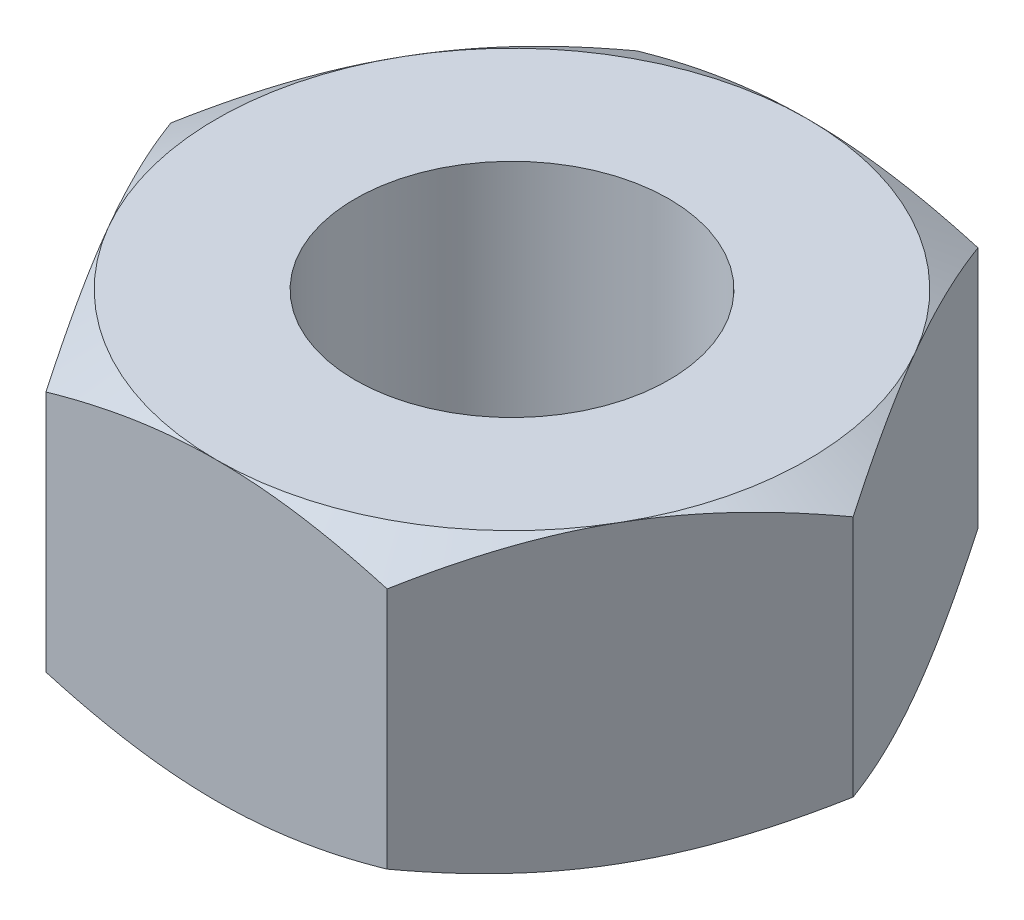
ISO-10303-21;
HEADER;
FILE_DESCRIPTION(('STEP AP214'),'2;1');
FILE_NAME('part.step','',(''),(''),'','','');
FILE_SCHEMA(('AUTOMOTIVE_DESIGN { 1 0 10303 214 1 1 1 1 }'));
ENDSEC;
DATA;
#1=APPLICATION_CONTEXT('core data for automotive mechanical design processes');
#2=APPLICATION_PROTOCOL_DEFINITION('international standard','automotive_design',2000,#1);
#3=PRODUCT_CONTEXT('',#1,'mechanical');
#4=PRODUCT('Part','Part','',(#3));
#5=PRODUCT_RELATED_PRODUCT_CATEGORY('part','',(#4));
#6=PRODUCT_DEFINITION_FORMATION('','',#4);
#7=PRODUCT_DEFINITION_CONTEXT('part definition',#1,'design');
#8=PRODUCT_DEFINITION('design','',#6,#7);
#9=PRODUCT_DEFINITION_SHAPE('','',#8);
#10=(LENGTH_UNIT() NAMED_UNIT(*) SI_UNIT(.MILLI.,.METRE.));
#11=(NAMED_UNIT(*) PLANE_ANGLE_UNIT() SI_UNIT($,.RADIAN.));
#12=(NAMED_UNIT(*) SI_UNIT($,.STERADIAN.) SOLID_ANGLE_UNIT());
#13=UNCERTAINTY_MEASURE_WITH_UNIT(LENGTH_MEASURE(1.E-05),#10,'distance_accuracy_value','');
#14=(GEOMETRIC_REPRESENTATION_CONTEXT(3) GLOBAL_UNCERTAINTY_ASSIGNED_CONTEXT((#13)) GLOBAL_UNIT_ASSIGNED_CONTEXT((#10,
#11,#12)) REPRESENTATION_CONTEXT('',''));
#15=CARTESIAN_POINT('',(0.,0.,0.));
#16=DIRECTION('',(0.,0.,1.));
#17=DIRECTION('',(1.,0.,0.));
#18=AXIS2_PLACEMENT_3D('',#15,#16,#17);
#19=CARTESIAN_POINT('',(4.61880215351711,8.,7.99999999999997));
#20=DIRECTION('',(-0.866025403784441,0.,-0.499999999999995));
#21=DIRECTION('',(-0.499999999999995,0.,0.866025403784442));
#22=AXIS2_PLACEMENT_3D('',#19,#20,#21);
#23=PLANE('',#22);
#24=CARTESIAN_POINT('',(9.23771977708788,0.71459784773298,-0.000200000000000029));
#25=CARTESIAN_POINT('',(9.13619343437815,0.655990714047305,0.175648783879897));
#26=CARTESIAN_POINT('',(9.0342885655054,0.600043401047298,0.352153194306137));
#27=CARTESIAN_POINT('',(8.82965122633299,0.494201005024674,0.706595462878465));
#28=CARTESIAN_POINT('',(8.72691841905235,0.444308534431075,0.884533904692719));
#29=CARTESIAN_POINT('',(8.41707512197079,0.304692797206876,1.42119823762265));
#30=CARTESIAN_POINT('',(8.20874154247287,0.225281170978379,1.78204258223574));
#31=CARTESIAN_POINT('',(7.89697436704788,0.132161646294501,2.32203917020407));
#32=CARTESIAN_POINT('',(7.79447216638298,0.105634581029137,2.4995781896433));
#33=CARTESIAN_POINT('',(7.58900421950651,0.0611531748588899,2.85545911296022));
#34=CARTESIAN_POINT('',(7.48603851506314,0.0431980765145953,3.03380094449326));
#35=CARTESIAN_POINT('',(7.2799298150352,0.0163156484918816,3.39079168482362));
#36=CARTESIAN_POINT('',(7.17678715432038,0.00737807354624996,3.56944001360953));
#37=CARTESIAN_POINT('',(6.97040655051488,-0.00127769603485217,3.92690170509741));
#38=CARTESIAN_POINT('',(6.86716861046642,-0.000996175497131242,4.10571506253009));
#39=CARTESIAN_POINT('',(6.67416139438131,0.00814502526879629,4.44001336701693));
#40=CARTESIAN_POINT('',(6.5843784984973,0.0158896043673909,4.5955219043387));
#41=CARTESIAN_POINT('',(6.40502298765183,0.0382011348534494,4.90617476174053));
#42=CARTESIAN_POINT('',(6.31545038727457,0.0527685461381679,5.06131905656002));
#43=CARTESIAN_POINT('',(6.0470793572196,0.106360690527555,5.52615131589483));
#44=CARTESIAN_POINT('',(5.86875596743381,0.155268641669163,5.83501648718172));
#45=CARTESIAN_POINT('',(5.51021755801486,0.27753940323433,6.45602322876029));
#46=CARTESIAN_POINT('',(5.33004829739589,0.351420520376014,6.76808554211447));
#47=CARTESIAN_POINT('',(4.97239658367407,0.519100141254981,7.38755648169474));
#48=CARTESIAN_POINT('',(4.79490955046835,0.612859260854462,7.69497304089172));
#49=CARTESIAN_POINT('',(4.61868668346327,0.71459784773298,8.00019999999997));
#50=B_SPLINE_CURVE_WITH_KNOTS('',3,(#24,#25,#26,#27,#28,#29,#30,#31,#32,#33,#34,#35,#36,#37,#38,
#39,#40,#41,#42,#43,#44,#45,#46,#47,#48,#49),.UNSPECIFIED.,.F.,.F.,(4,2,2,2,2,2,2,2,2,2,2,2,4),
(0.,0.633973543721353,1.26821965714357,2.53934712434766,3.1593434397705,3.77928496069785,
4.39852133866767,5.01773858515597,5.55680239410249,6.09590254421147,7.17487077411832,
8.27776850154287,9.37850115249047),.UNSPECIFIED.);
#51=CARTESIAN_POINT('',(9.23760430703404,0.714531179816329,0.));
#52=VERTEX_POINT('',#51);
#53=CARTESIAN_POINT('',(6.92820323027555,0.,3.99999999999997));
#54=VERTEX_POINT('',#53);
#55=EDGE_CURVE('E61',#52,#54,#50,.T.);
#56=ORIENTED_EDGE('',*,*,#55,.F.);
#57=DIRECTION('',(0.,-1.,0.));
#58=VECTOR('',#57,1.);
#59=CARTESIAN_POINT('',(9.23760430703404,8.,0.));
#60=LINE('',#59,#58);
#61=CARTESIAN_POINT('',(9.23760430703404,7.28546882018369,0.));
#62=VERTEX_POINT('',#61);
#63=EDGE_CURVE('E178',#62,#52,#60,.T.);
#64=ORIENTED_EDGE('',*,*,#63,.F.);
#65=CARTESIAN_POINT('',(4.61868668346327,7.28540215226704,8.00019999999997));
#66=CARTESIAN_POINT('',(4.720213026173,7.34400928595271,7.82435121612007));
#67=CARTESIAN_POINT('',(4.82211789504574,7.39995659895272,7.64784680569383));
#68=CARTESIAN_POINT('',(5.02675523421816,7.50579899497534,7.2934045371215));
#69=CARTESIAN_POINT('',(5.1294880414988,7.55569146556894,7.11546609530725));
#70=CARTESIAN_POINT('',(5.43933133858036,7.69530720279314,6.57880176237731));
#71=CARTESIAN_POINT('',(5.64766491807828,7.77471882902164,6.21795741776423));
#72=CARTESIAN_POINT('',(5.95943209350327,7.86783835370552,5.6779608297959));
#73=CARTESIAN_POINT('',(6.06193429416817,7.89436541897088,5.50042181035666));
#74=CARTESIAN_POINT('',(6.26740224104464,7.93884682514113,5.14454088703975));
#75=CARTESIAN_POINT('',(6.37036794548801,7.95680192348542,4.96619905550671));
#76=CARTESIAN_POINT('',(6.57647664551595,7.98368435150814,4.60920831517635));
#77=CARTESIAN_POINT('',(6.67961930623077,7.99262192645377,4.43055998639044));
#78=CARTESIAN_POINT('',(6.88599991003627,8.00127769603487,4.07309829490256));
#79=CARTESIAN_POINT('',(6.98923785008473,8.00099617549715,3.89428493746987));
#80=CARTESIAN_POINT('',(7.18224506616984,7.99185497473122,3.55998663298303));
#81=CARTESIAN_POINT('',(7.27202796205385,7.98411039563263,3.40447809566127));
#82=CARTESIAN_POINT('',(7.45138347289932,7.96179886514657,3.09382523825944));
#83=CARTESIAN_POINT('',(7.54095607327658,7.94723145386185,2.93868094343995));
#84=CARTESIAN_POINT('',(7.80932710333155,7.89363930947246,2.47384868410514));
#85=CARTESIAN_POINT('',(7.98765049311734,7.84473135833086,2.16498351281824));
#86=CARTESIAN_POINT('',(8.34618890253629,7.72246059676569,1.54397677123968));
#87=CARTESIAN_POINT('',(8.52635816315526,7.64857947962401,1.2319144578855));
#88=CARTESIAN_POINT('',(8.88400987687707,7.48089985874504,0.612443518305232));
#89=CARTESIAN_POINT('',(9.0614969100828,7.38714073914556,0.305026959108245));
#90=CARTESIAN_POINT('',(9.23771977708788,7.28540215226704,-0.000200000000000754));
#91=B_SPLINE_CURVE_WITH_KNOTS('',3,(#65,#66,#67,#68,#69,#70,#71,#72,#73,#74,#75,#76,#77,#78,#79,
#80,#81,#82,#83,#84,#85,#86,#87,#88,#89,#90),.UNSPECIFIED.,.F.,.F.,(4,2,2,2,2,2,2,2,2,2,2,2,4),
(0.,0.633973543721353,1.26821965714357,2.53934712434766,3.1593434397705,3.77928496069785,
4.39852133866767,5.01773858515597,5.55680239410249,6.09590254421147,7.17487077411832,
8.27776850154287,9.37850115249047),.UNSPECIFIED.);
#92=CARTESIAN_POINT('',(6.92820323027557,8.,3.99999999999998));
#93=VERTEX_POINT('',#92);
#94=EDGE_CURVE('E252',#93,#62,#91,.T.);
#95=ORIENTED_EDGE('',*,*,#94,.F.);
#96=CARTESIAN_POINT('',(4.61880215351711,7.28546882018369,7.99999999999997));
#97=VERTEX_POINT('',#96);
#98=EDGE_CURVE('E338',#97,#93,#91,.T.);
#99=ORIENTED_EDGE('',*,*,#98,.F.);
#100=DIRECTION('',(0.,-1.,0.));
#101=VECTOR('',#100,1.);
#102=CARTESIAN_POINT('',(4.61880215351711,8.,7.99999999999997));
#103=LINE('',#102,#101);
#104=CARTESIAN_POINT('',(4.61880215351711,0.714531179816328,7.99999999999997));
#105=VERTEX_POINT('',#104);
#106=EDGE_CURVE('E164',#97,#105,#103,.T.);
#107=ORIENTED_EDGE('',*,*,#106,.T.);
#108=EDGE_CURVE('E156',#54,#105,#50,.T.);
#109=ORIENTED_EDGE('',*,*,#108,.F.);
#110=EDGE_LOOP('',(#56,#64,#95,#99,#107,#109));
#111=FACE_BOUND('',#110,.T.);
#112=ADVANCED_FACE('F45',(#111),#23,.F.);
#113=CARTESIAN_POINT('',(9.23760430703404,8.,0.));
#114=DIRECTION('',(-0.866025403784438,0.,0.500000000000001));
#115=DIRECTION('',(0.500000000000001,0.,0.866025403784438));
#116=AXIS2_PLACEMENT_3D('',#113,#114,#115);
#117=PLANE('',#116);
#118=CARTESIAN_POINT('',(4.61868668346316,0.714597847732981,-8.00020000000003));
#119=CARTESIAN_POINT('',(4.72021302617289,0.655990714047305,-7.82435121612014));
#120=CARTESIAN_POINT('',(4.82211789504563,0.600043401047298,-7.6478468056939));
#121=CARTESIAN_POINT('',(5.02675523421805,0.494201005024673,-7.29340453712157));
#122=CARTESIAN_POINT('',(5.12948804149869,0.444308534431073,-7.11546609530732));
#123=CARTESIAN_POINT('',(5.43933133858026,0.30469279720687,-6.57880176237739));
#124=CARTESIAN_POINT('',(5.64766491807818,0.225281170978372,-6.21795741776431));
#125=CARTESIAN_POINT('',(5.95943209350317,0.132161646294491,-5.67796082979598));
#126=CARTESIAN_POINT('',(6.06193429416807,0.105634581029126,-5.50042181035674));
#127=CARTESIAN_POINT('',(6.26740224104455,0.0611531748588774,-5.14454088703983));
#128=CARTESIAN_POINT('',(6.37036794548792,0.0431980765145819,-4.96619905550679));
#129=CARTESIAN_POINT('',(6.57647664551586,0.0163156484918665,-4.60920831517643));
#130=CARTESIAN_POINT('',(6.67961930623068,0.00737807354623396,-4.43055998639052));
#131=CARTESIAN_POINT('',(6.88599991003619,-0.0012776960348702,-4.07309829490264));
#132=CARTESIAN_POINT('',(6.98923785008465,-0.000996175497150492,-3.89428493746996));
#133=CARTESIAN_POINT('',(7.18224506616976,0.00814502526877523,-3.55998663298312));
#134=CARTESIAN_POINT('',(7.27202796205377,0.0158896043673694,-3.40447809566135));
#135=CARTESIAN_POINT('',(7.45138347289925,0.0382011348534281,-3.09382523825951));
#136=CARTESIAN_POINT('',(7.54095607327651,0.0527685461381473,-2.93868094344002));
#137=CARTESIAN_POINT('',(7.8093271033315,0.106360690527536,-2.4738486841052));
#138=CARTESIAN_POINT('',(7.98765049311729,0.155268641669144,-2.16498351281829));
#139=CARTESIAN_POINT('',(8.34618890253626,0.277539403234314,-1.54397677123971));
#140=CARTESIAN_POINT('',(8.52635816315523,0.351420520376,-1.23191445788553));
#141=CARTESIAN_POINT('',(8.88400987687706,0.519100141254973,-0.612443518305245));
#142=CARTESIAN_POINT('',(9.06149691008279,0.612859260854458,-0.305026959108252));
#143=CARTESIAN_POINT('',(9.23771977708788,0.714597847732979,0.00019999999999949));
#144=B_SPLINE_CURVE_WITH_KNOTS('',3,(#118,#119,#120,#121,#122,#123,#124,#125,#126,#127,#128,
#129,#130,#131,#132,#133,#134,#135,#136,#137,#138,#139,#140,#141,#142,#143),.UNSPECIFIED.,.F.,
.F.,(4,2,2,2,2,2,2,2,2,2,2,2,4),(0.,0.633973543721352,1.26821965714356,2.53934712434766,
3.1593434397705,3.77928496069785,4.39852133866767,5.01773858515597,5.55680239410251,
6.0959025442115,7.17487077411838,8.27776850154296,9.37850115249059),.UNSPECIFIED.);
#145=CARTESIAN_POINT('',(4.618802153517,0.714531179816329,-8.00000000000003));
#146=VERTEX_POINT('',#145);
#147=CARTESIAN_POINT('',(6.92820323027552,0.,-4.00000000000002));
#148=VERTEX_POINT('',#147);
#149=EDGE_CURVE('E68',#146,#148,#144,.T.);
#150=ORIENTED_EDGE('',*,*,#149,.F.);
#151=DIRECTION('',(0.,-1.,0.));
#152=VECTOR('',#151,1.);
#153=CARTESIAN_POINT('',(4.618802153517,8.,-8.00000000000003));
#154=LINE('',#153,#152);
#155=CARTESIAN_POINT('',(4.618802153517,7.28546882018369,-8.00000000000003));
#156=VERTEX_POINT('',#155);
#157=EDGE_CURVE('E175',#156,#146,#154,.T.);
#158=ORIENTED_EDGE('',*,*,#157,.F.);
#159=CARTESIAN_POINT('',(9.23771977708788,7.28540215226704,0.000200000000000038));
#160=CARTESIAN_POINT('',(9.13619343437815,7.34400928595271,-0.175648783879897));
#161=CARTESIAN_POINT('',(9.0342885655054,7.39995659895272,-0.352153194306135));
#162=CARTESIAN_POINT('',(8.82965122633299,7.50579899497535,-0.70659546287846));
#163=CARTESIAN_POINT('',(8.72691841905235,7.55569146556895,-0.884533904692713));
#164=CARTESIAN_POINT('',(8.41707512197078,7.69530720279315,-1.42119823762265));
#165=CARTESIAN_POINT('',(8.20874154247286,7.77471882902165,-1.78204258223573));
#166=CARTESIAN_POINT('',(7.89697436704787,7.86783835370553,-2.32203917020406));
#167=CARTESIAN_POINT('',(7.79447216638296,7.89436541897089,-2.49957818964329));
#168=CARTESIAN_POINT('',(7.58900421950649,7.93884682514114,-2.85545911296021));
#169=CARTESIAN_POINT('',(7.48603851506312,7.95680192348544,-3.03380094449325));
#170=CARTESIAN_POINT('',(7.27992981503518,7.98368435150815,-3.3907916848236));
#171=CARTESIAN_POINT('',(7.17678715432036,7.99262192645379,-3.56944001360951));
#172=CARTESIAN_POINT('',(6.97040655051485,8.00127769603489,-3.92690170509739));
#173=CARTESIAN_POINT('',(6.86716861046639,8.00099617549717,-4.10571506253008));
#174=CARTESIAN_POINT('',(6.67416139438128,7.99185497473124,-4.44001336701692));
#175=CARTESIAN_POINT('',(6.58437849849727,7.98411039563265,-4.59552190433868));
#176=CARTESIAN_POINT('',(6.40502298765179,7.96179886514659,-4.90617476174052));
#177=CARTESIAN_POINT('',(6.31545038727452,7.94723145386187,-5.06131905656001));
#178=CARTESIAN_POINT('',(6.04707935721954,7.89363930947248,-5.52615131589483));
#179=CARTESIAN_POINT('',(5.86875596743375,7.84473135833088,-5.83501648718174));
#180=CARTESIAN_POINT('',(5.51021755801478,7.72246059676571,-6.45602322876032));
#181=CARTESIAN_POINT('',(5.33004829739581,7.64857947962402,-6.7680855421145));
#182=CARTESIAN_POINT('',(4.97239658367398,7.48089985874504,-7.38755648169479));
#183=CARTESIAN_POINT('',(4.79490955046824,7.38714073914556,-7.69497304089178));
#184=CARTESIAN_POINT('',(4.61868668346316,7.28540215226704,-8.00020000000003));
#185=B_SPLINE_CURVE_WITH_KNOTS('',3,(#159,#160,#161,#162,#163,#164,#165,#166,#167,#168,#169,
#170,#171,#172,#173,#174,#175,#176,#177,#178,#179,#180,#181,#182,#183,#184),.UNSPECIFIED.,.F.,
.F.,(4,2,2,2,2,2,2,2,2,2,2,2,4),(0.,0.633973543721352,1.26821965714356,2.53934712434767,
3.1593434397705,3.77928496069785,4.39852133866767,5.01773858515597,5.55680239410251,
6.0959025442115,7.17487077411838,8.27776850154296,9.37850115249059),.UNSPECIFIED.);
#186=CARTESIAN_POINT('',(6.92820323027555,8.,-4.00000000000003));
#187=VERTEX_POINT('',#186);
#188=EDGE_CURVE('E315',#187,#156,#185,.T.);
#189=ORIENTED_EDGE('',*,*,#188,.F.);
#190=EDGE_CURVE('E320',#62,#187,#185,.T.);
#191=ORIENTED_EDGE('',*,*,#190,.F.);
#192=ORIENTED_EDGE('',*,*,#63,.T.);
#193=EDGE_CURVE('E297',#148,#52,#144,.T.);
#194=ORIENTED_EDGE('',*,*,#193,.F.);
#195=EDGE_LOOP('',(#150,#158,#189,#191,#192,#194));
#196=FACE_BOUND('',#195,.T.);
#197=ADVANCED_FACE('F308',(#196),#117,.F.);
#198=CARTESIAN_POINT('',(4.618802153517,8.,-8.00000000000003));
#199=DIRECTION('',(0.,0.,1.));
#200=DIRECTION('',(1.,0.,0.));
#201=AXIS2_PLACEMENT_3D('',#198,#199,#200);
#202=PLANE('',#201);
#203=CARTESIAN_POINT('',(-12.6403241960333,4.01789852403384,-7.99999999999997));
#204=CARTESIAN_POINT('',(-12.2888430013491,3.84647215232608,-7.99999999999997));
#205=CARTESIAN_POINT('',(-11.9365795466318,3.67662339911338,-7.99999999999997));
#206=CARTESIAN_POINT('',(-11.2300728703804,3.34096412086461,-7.99999999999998));
#207=CARTESIAN_POINT('',(-10.8758293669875,3.17515418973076,-7.99999999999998));
#208=CARTESIAN_POINT('',(-10.1632322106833,2.84767085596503,-7.99999999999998));
#209=CARTESIAN_POINT('',(-9.80486680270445,2.68602294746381,-7.99999999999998));
#210=CARTESIAN_POINT('',(-9.08536584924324,2.36903857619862,-7.99999999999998));
#211=CARTESIAN_POINT('',(-8.72423042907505,2.21370182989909,-7.99999999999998));
#212=CARTESIAN_POINT('',(-7.98618087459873,1.90581143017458,-7.99999999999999));
#213=CARTESIAN_POINT('',(-7.60915019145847,1.75353567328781,-7.99999999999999));
#214=CARTESIAN_POINT('',(-6.85076602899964,1.45995337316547,-7.99999999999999));
#215=CARTESIAN_POINT('',(-6.46941208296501,1.31864802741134,-7.99999999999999));
#216=CARTESIAN_POINT('',(-5.70241102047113,1.05054563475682,-8.));
#217=CARTESIAN_POINT('',(-5.3167735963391,0.923721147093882,-8.));
#218=CARTESIAN_POINT('',(-4.53998544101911,0.688493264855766,-8.));
#219=CARTESIAN_POINT('',(-4.14883641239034,0.580084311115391,-8.));
#220=CARTESIAN_POINT('',(-3.36291309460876,0.387316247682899,-8.00000000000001));
#221=CARTESIAN_POINT('',(-2.96817310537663,0.30282097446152,-8.00000000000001));
#222=CARTESIAN_POINT('',(-2.37228929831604,0.197556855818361,-8.00000000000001));
#223=CARTESIAN_POINT('',(-2.17301971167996,0.16604730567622,-8.00000000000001));
#224=CARTESIAN_POINT('',(-1.77341268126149,0.110799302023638,-8.00000000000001));
#225=CARTESIAN_POINT('',(-1.57307534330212,0.0870600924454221,-8.00000000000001));
#226=CARTESIAN_POINT('',(-1.17432002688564,0.0481362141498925,-8.00000000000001));
#227=CARTESIAN_POINT('',(-0.975913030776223,0.0328395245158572,-8.00000000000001));
#228=CARTESIAN_POINT('',(-0.57862915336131,0.010658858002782,-8.00000000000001));
#229=CARTESIAN_POINT('',(-0.379752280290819,0.00377473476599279,-8.00000000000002));
#230=CARTESIAN_POINT('',(0.0181162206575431,-0.00141546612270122,-8.00000000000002));
#231=CARTESIAN_POINT('',(0.217107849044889,0.000278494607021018,-8.00000000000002));
#232=CARTESIAN_POINT('',(0.614837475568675,0.0122006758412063,-8.00000000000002));
#233=CARTESIAN_POINT('',(0.813575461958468,0.0224292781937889,-8.00000000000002));
#234=CARTESIAN_POINT('',(1.28422959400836,0.0565371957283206,-8.00000000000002));
#235=CARTESIAN_POINT('',(1.55588667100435,0.0840774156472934,-8.00000000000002));
#236=CARTESIAN_POINT('',(2.09732305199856,0.153653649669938,-8.00000000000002));
#237=CARTESIAN_POINT('',(2.36710212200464,0.195691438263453,-8.00000000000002));
#238=CARTESIAN_POINT('',(3.17322847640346,0.34133323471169,-8.00000000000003));
#239=CARTESIAN_POINT('',(3.70610589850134,0.464444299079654,-8.00000000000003));
#240=CARTESIAN_POINT('',(4.5033868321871,0.679733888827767,-8.00000000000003));
#241=CARTESIAN_POINT('',(4.77187301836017,0.757678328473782,-8.00000000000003));
#242=CARTESIAN_POINT('',(5.30624232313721,0.922110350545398,-8.00000000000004));
#243=CARTESIAN_POINT('',(5.57212542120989,1.00859800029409,-8.00000000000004));
#244=CARTESIAN_POINT('',(6.10136688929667,1.18869198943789,-8.00000000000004));
#245=CARTESIAN_POINT('',(6.36472592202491,1.28229639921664,-8.00000000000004));
#246=CARTESIAN_POINT('',(6.88922947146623,1.47547803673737,-8.00000000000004));
#247=CARTESIAN_POINT('',(7.15037404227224,1.57505511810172,-8.00000000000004));
#248=CARTESIAN_POINT('',(7.86355537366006,1.85485523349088,-8.00000000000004));
#249=CARTESIAN_POINT('',(8.31360309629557,2.04014375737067,-8.00000000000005));
#250=CARTESIAN_POINT('',(9.20895547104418,2.4218876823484,-8.00000000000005));
#251=CARTESIAN_POINT('',(9.65425955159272,2.61834441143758,-8.00000000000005));
#252=CARTESIAN_POINT('',(10.5412363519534,3.01973675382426,-8.00000000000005));
#253=CARTESIAN_POINT('',(10.9829075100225,3.2246758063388,-8.00000000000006));
#254=CARTESIAN_POINT('',(11.8631821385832,3.64096813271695,-8.00000000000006));
#255=CARTESIAN_POINT('',(12.3017857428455,3.8523211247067,-8.00000000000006));
#256=CARTESIAN_POINT('',(13.1772814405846,4.28038318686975,-8.00000000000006));
#257=CARTESIAN_POINT('',(13.6141694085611,4.49710067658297,-8.00000000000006));
#258=CARTESIAN_POINT('',(14.4859595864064,4.93449647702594,-8.00000000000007));
#259=CARTESIAN_POINT('',(14.9208617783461,5.15517482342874,-8.00000000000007));
#260=CARTESIAN_POINT('',(15.7889376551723,5.59965094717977,-8.00000000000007));
#261=CARTESIAN_POINT('',(16.2221117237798,5.82344797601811,-8.00000000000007));
#262=CARTESIAN_POINT('',(17.0871185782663,6.27362077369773,-8.00000000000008));
#263=CARTESIAN_POINT('',(17.5189513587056,6.49999655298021,-8.00000000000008));
#264=CARTESIAN_POINT('',(18.71912958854,7.13289882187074,-8.00000000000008));
#265=CARTESIAN_POINT('',(19.4862640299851,7.54172124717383,-8.00000000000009));
#266=CARTESIAN_POINT('',(21.0179839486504,8.36422301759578,-8.00000000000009));
#267=CARTESIAN_POINT('',(21.782569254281,8.77790268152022,-8.00000000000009));
#268=CARTESIAN_POINT('',(23.3071112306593,9.60742602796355,-8.0000000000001));
#269=CARTESIAN_POINT('',(24.0670747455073,10.0232571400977,-8.0000000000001));
#270=CARTESIAN_POINT('',(25.2058550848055,10.6490471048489,-8.00000000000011));
#271=CARTESIAN_POINT('',(25.5852388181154,10.8579756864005,-8.00000000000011));
#272=CARTESIAN_POINT('',(26.34366906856,11.2764429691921,-8.00000000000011));
#273=CARTESIAN_POINT('',(26.7227155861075,11.4859816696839,-8.00000000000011));
#274=CARTESIAN_POINT('',(27.1016142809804,11.6957873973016,-8.00000000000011));
#275=B_SPLINE_CURVE_WITH_KNOTS('',3,(#203,#204,#205,#206,#207,#208,#209,#210,#211,#212,#213,
#214,#215,#216,#217,#218,#219,#220,#221,#222,#223,#224,#225,#226,#227,#228,#229,#230,#231,#232,
#233,#234,#235,#236,#237,#238,#239,#240,#241,#242,#243,#244,#245,#246,#247,#248,#249,#250,#251,
#252,#253,#254,#255,#256,#257,#258,#259,#260,#261,#262,#263,#264,#265,#266,#267,#268,#269,#270,
#271,#272,#273,#274),.UNSPECIFIED.,.F.,.F.,(4,2,2,2,2,2,2,2,2,2,2,2,2,2,2,2,2,2,2,2,2,2,2,2,2,2,
2,2,2,2,2,2,2,2,2,4),(0.,1.17318598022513,2.3465434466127,3.52590216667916,4.70520784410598,
5.92493599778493,7.14479710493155,8.36230684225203,9.57944838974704,10.7895133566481,
11.3946221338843,11.9996720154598,12.5964878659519,13.1932933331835,13.7901014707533,
14.3869363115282,15.2056272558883,16.0244184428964,17.6627769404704,18.5014144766,
19.3400586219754,20.1784761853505,21.0168732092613,22.4767387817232,23.936778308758,
25.3974157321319,26.857989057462,28.321021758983,29.7840676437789,31.2467682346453,
32.7094747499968,35.3172586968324,37.9252147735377,40.5240797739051,41.8234055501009,
43.1227297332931),.UNSPECIFIED.);
#276=CARTESIAN_POINT('',(-4.61880215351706,0.714531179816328,-8.));
#277=VERTEX_POINT('',#276);
#278=CARTESIAN_POINT('',(0.,0.,-8.00000000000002));
#279=VERTEX_POINT('',#278);
#280=EDGE_CURVE('E329',#277,#279,#275,.T.);
#281=ORIENTED_EDGE('',*,*,#280,.F.);
#282=DIRECTION('',(0.,-1.,0.));
#283=VECTOR('',#282,1.);
#284=CARTESIAN_POINT('',(-4.61880215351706,8.,-8.));
#285=LINE('',#284,#283);
#286=CARTESIAN_POINT('',(-4.61880215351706,7.28546882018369,-8.));
#287=VERTEX_POINT('',#286);
#288=EDGE_CURVE('E166',#287,#277,#285,.T.);
#289=ORIENTED_EDGE('',*,*,#288,.F.);
#290=CARTESIAN_POINT('',(-12.6403241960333,3.98210147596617,-7.99999999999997));
#291=CARTESIAN_POINT('',(-12.2888430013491,4.15352784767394,-7.99999999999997));
#292=CARTESIAN_POINT('',(-11.9365795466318,4.32337660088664,-7.99999999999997));
#293=CARTESIAN_POINT('',(-11.2300728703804,4.6590358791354,-7.99999999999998));
#294=CARTESIAN_POINT('',(-10.8758293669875,4.82484581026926,-7.99999999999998));
#295=CARTESIAN_POINT('',(-10.1632322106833,5.15232914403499,-7.99999999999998));
#296=CARTESIAN_POINT('',(-9.80486680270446,5.3139770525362,-7.99999999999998));
#297=CARTESIAN_POINT('',(-9.08536584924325,5.6309614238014,-7.99999999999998));
#298=CARTESIAN_POINT('',(-8.72423042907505,5.78629817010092,-7.99999999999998));
#299=CARTESIAN_POINT('',(-7.98618087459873,6.09418856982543,-7.99999999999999));
#300=CARTESIAN_POINT('',(-7.60915019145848,6.24646432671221,-7.99999999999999));
#301=CARTESIAN_POINT('',(-6.85076602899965,6.54004662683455,-7.99999999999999));
#302=CARTESIAN_POINT('',(-6.46941208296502,6.68135197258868,-7.99999999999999));
#303=CARTESIAN_POINT('',(-5.70241102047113,6.9494543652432,-8.));
#304=CARTESIAN_POINT('',(-5.31677359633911,7.07627885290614,-8.));
#305=CARTESIAN_POINT('',(-4.53998544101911,7.31150673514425,-8.));
#306=CARTESIAN_POINT('',(-4.14883641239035,7.41991568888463,-8.));
#307=CARTESIAN_POINT('',(-3.36291309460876,7.61268375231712,-8.00000000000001));
#308=CARTESIAN_POINT('',(-2.96817310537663,7.6971790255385,-8.00000000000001));
#309=CARTESIAN_POINT('',(-2.37228929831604,7.80244314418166,-8.00000000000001));
#310=CARTESIAN_POINT('',(-2.17301971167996,7.8339526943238,-8.00000000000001));
#311=CARTESIAN_POINT('',(-1.77341268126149,7.88920069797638,-8.00000000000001));
#312=CARTESIAN_POINT('',(-1.57307534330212,7.9129399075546,-8.00000000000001));
#313=CARTESIAN_POINT('',(-1.17432002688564,7.95186378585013,-8.00000000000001));
#314=CARTESIAN_POINT('',(-0.975913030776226,7.96716047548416,-8.00000000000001));
#315=CARTESIAN_POINT('',(-0.578629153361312,7.98934114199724,-8.00000000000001));
#316=CARTESIAN_POINT('',(-0.379752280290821,7.99622526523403,-8.00000000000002));
#317=CARTESIAN_POINT('',(0.0181162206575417,8.00141546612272,-8.00000000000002));
#318=CARTESIAN_POINT('',(0.217107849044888,7.999721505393,-8.00000000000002));
#319=CARTESIAN_POINT('',(0.614837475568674,7.98779932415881,-8.00000000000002));
#320=CARTESIAN_POINT('',(0.813575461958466,7.97757072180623,-8.00000000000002));
#321=CARTESIAN_POINT('',(1.28422959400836,7.9434628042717,-8.00000000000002));
#322=CARTESIAN_POINT('',(1.55588667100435,7.91592258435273,-8.00000000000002));
#323=CARTESIAN_POINT('',(2.09732305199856,7.84634635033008,-8.00000000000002));
#324=CARTESIAN_POINT('',(2.36710212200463,7.80430856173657,-8.00000000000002));
#325=CARTESIAN_POINT('',(3.17322847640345,7.65866676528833,-8.00000000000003));
#326=CARTESIAN_POINT('',(3.70610589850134,7.53555570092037,-8.00000000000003));
#327=CARTESIAN_POINT('',(4.50338683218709,7.32026611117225,-8.00000000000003));
#328=CARTESIAN_POINT('',(4.77187301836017,7.24232167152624,-8.00000000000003));
#329=CARTESIAN_POINT('',(5.30624232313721,7.07788964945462,-8.00000000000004));
#330=CARTESIAN_POINT('',(5.57212542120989,6.99140199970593,-8.00000000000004));
#331=CARTESIAN_POINT('',(6.10136688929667,6.81130801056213,-8.00000000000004));
#332=CARTESIAN_POINT('',(6.36472592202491,6.71770360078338,-8.00000000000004));
#333=CARTESIAN_POINT('',(6.88922947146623,6.52452196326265,-8.00000000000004));
#334=CARTESIAN_POINT('',(7.15037404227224,6.4249448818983,-8.00000000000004));
#335=CARTESIAN_POINT('',(7.86355537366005,6.14514476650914,-8.00000000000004));
#336=CARTESIAN_POINT('',(8.31360309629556,5.95985624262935,-8.00000000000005));
#337=CARTESIAN_POINT('',(9.20895547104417,5.57811231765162,-8.00000000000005));
#338=CARTESIAN_POINT('',(9.65425955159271,5.38165558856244,-8.00000000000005));
#339=CARTESIAN_POINT('',(10.5412363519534,4.98026324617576,-8.00000000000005));
#340=CARTESIAN_POINT('',(10.9829075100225,4.77532419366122,-8.00000000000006));
#341=CARTESIAN_POINT('',(11.8631821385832,4.35903186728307,-8.00000000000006));
#342=CARTESIAN_POINT('',(12.3017857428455,4.14767887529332,-8.00000000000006));
#343=CARTESIAN_POINT('',(13.1772814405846,3.71961681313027,-8.00000000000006));
#344=CARTESIAN_POINT('',(13.6141694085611,3.50289932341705,-8.00000000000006));
#345=CARTESIAN_POINT('',(14.4859595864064,3.06550352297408,-8.00000000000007));
#346=CARTESIAN_POINT('',(14.9208617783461,2.84482517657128,-8.00000000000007));
#347=CARTESIAN_POINT('',(15.7889376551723,2.40034905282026,-8.00000000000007));
#348=CARTESIAN_POINT('',(16.2221117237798,2.17655202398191,-8.00000000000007));
#349=CARTESIAN_POINT('',(17.0871185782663,1.72637922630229,-8.00000000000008));
#350=CARTESIAN_POINT('',(17.5189513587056,1.50000344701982,-8.00000000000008));
#351=CARTESIAN_POINT('',(18.71912958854,0.867101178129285,-8.00000000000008));
#352=CARTESIAN_POINT('',(19.4862640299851,0.458278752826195,-8.00000000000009));
#353=CARTESIAN_POINT('',(21.0179839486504,-0.364223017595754,-8.00000000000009));
#354=CARTESIAN_POINT('',(21.782569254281,-0.777902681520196,-8.00000000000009));
#355=CARTESIAN_POINT('',(23.3071112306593,-1.60742602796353,-8.0000000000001));
#356=CARTESIAN_POINT('',(24.0670747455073,-2.0232571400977,-8.0000000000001));
#357=CARTESIAN_POINT('',(25.2058550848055,-2.64904710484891,-8.00000000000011));
#358=CARTESIAN_POINT('',(25.5852388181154,-2.85797568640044,-8.00000000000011));
#359=CARTESIAN_POINT('',(26.34366906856,-3.27644296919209,-8.00000000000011));
#360=CARTESIAN_POINT('',(26.7227155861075,-3.48598166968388,-8.00000000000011));
#361=CARTESIAN_POINT('',(27.1016142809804,-3.69578739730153,-8.00000000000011));
#362=B_SPLINE_CURVE_WITH_KNOTS('',3,(#290,#291,#292,#293,#294,#295,#296,#297,#298,#299,#300,
#301,#302,#303,#304,#305,#306,#307,#308,#309,#310,#311,#312,#313,#314,#315,#316,#317,#318,#319,
#320,#321,#322,#323,#324,#325,#326,#327,#328,#329,#330,#331,#332,#333,#334,#335,#336,#337,#338,
#339,#340,#341,#342,#343,#344,#345,#346,#347,#348,#349,#350,#351,#352,#353,#354,#355,#356,#357,
#358,#359,#360,#361),.UNSPECIFIED.,.F.,.F.,(4,2,2,2,2,2,2,2,2,2,2,2,2,2,2,2,2,2,2,2,2,2,2,2,2,2,
2,2,2,2,2,2,2,2,2,4),(0.,1.17318598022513,2.3465434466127,3.52590216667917,4.70520784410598,
5.92493599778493,7.14479710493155,8.36230684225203,9.57944838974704,10.7895133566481,
11.3946221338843,11.9996720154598,12.5964878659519,13.1932933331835,13.7901014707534,
14.3869363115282,15.2056272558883,16.0244184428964,17.6627769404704,18.5014144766,
19.3400586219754,20.1784761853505,21.0168732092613,22.4767387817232,23.936778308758,
25.3974157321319,26.857989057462,28.321021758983,29.7840676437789,31.2467682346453,
32.7094747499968,35.3172586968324,37.9252147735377,40.5240797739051,41.8234055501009,
43.122729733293),.UNSPECIFIED.);
#363=CARTESIAN_POINT('',(0.,8.,-8.00000000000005));
#364=VERTEX_POINT('',#363);
#365=EDGE_CURVE('E214',#364,#287,#362,.F.);
#366=ORIENTED_EDGE('',*,*,#365,.F.);
#367=EDGE_CURVE('E321',#156,#364,#362,.F.);
#368=ORIENTED_EDGE('',*,*,#367,.F.);
#369=ORIENTED_EDGE('',*,*,#157,.T.);
#370=EDGE_CURVE('E303',#279,#146,#275,.T.);
#371=ORIENTED_EDGE('',*,*,#370,.F.);
#372=EDGE_LOOP('',(#281,#289,#366,#368,#369,#371));
#373=FACE_BOUND('',#372,.T.);
#374=ADVANCED_FACE('F311',(#373),#202,.F.);
#375=CARTESIAN_POINT('',(-4.61880215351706,8.,-8.));
#376=DIRECTION('',(0.866025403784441,0.,0.499999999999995));
#377=DIRECTION('',(0.499999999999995,0.,-0.866025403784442));
#378=AXIS2_PLACEMENT_3D('',#375,#376,#377);
#379=PLANE('',#378);
#380=CARTESIAN_POINT('',(-9.23771977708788,0.71459784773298,0.000200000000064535));
#381=CARTESIAN_POINT('',(-9.13619343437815,0.655990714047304,-0.175648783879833));
#382=CARTESIAN_POINT('',(-9.03428856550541,0.600043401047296,-0.352153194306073));
#383=CARTESIAN_POINT('',(-8.82965122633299,0.494201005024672,-0.7065954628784));
#384=CARTESIAN_POINT('',(-8.72691841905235,0.444308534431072,-0.884533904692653));
#385=CARTESIAN_POINT('',(-8.41707512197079,0.30469279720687,-1.42119823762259));
#386=CARTESIAN_POINT('',(-8.20874154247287,0.225281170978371,-1.78204258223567));
#387=CARTESIAN_POINT('',(-7.89697436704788,0.132161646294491,-2.322039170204));
#388=CARTESIAN_POINT('',(-7.79447216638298,0.105634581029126,-2.49957818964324));
#389=CARTESIAN_POINT('',(-7.58900421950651,0.0611531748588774,-2.85545911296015));
#390=CARTESIAN_POINT('',(-7.48603851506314,0.043198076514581,-3.0338009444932));
#391=CARTESIAN_POINT('',(-7.2799298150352,0.0163156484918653,-3.39079168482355));
#392=CARTESIAN_POINT('',(-7.17678715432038,0.00737807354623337,-3.56944001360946));
#393=CARTESIAN_POINT('',(-6.97040655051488,-0.00127769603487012,-3.92690170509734));
#394=CARTESIAN_POINT('',(-6.86716861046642,-0.00099617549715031,-4.10571506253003));
#395=CARTESIAN_POINT('',(-6.67416139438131,0.00814502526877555,-4.44001336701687));
#396=CARTESIAN_POINT('',(-6.5843784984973,0.0158896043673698,-4.59552190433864));
#397=CARTESIAN_POINT('',(-6.40502298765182,0.0382011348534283,-4.90617476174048));
#398=CARTESIAN_POINT('',(-6.31545038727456,0.0527685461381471,-5.06131905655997));
#399=CARTESIAN_POINT('',(-6.04707935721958,0.106360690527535,-5.52615131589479));
#400=CARTESIAN_POINT('',(-5.86875596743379,0.155268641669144,-5.8350164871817));
#401=CARTESIAN_POINT('',(-5.51021755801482,0.277539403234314,-6.45602322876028));
#402=CARTESIAN_POINT('',(-5.33004829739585,0.351420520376,-6.76808554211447));
#403=CARTESIAN_POINT('',(-4.97239658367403,0.519100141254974,-7.38755648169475));
#404=CARTESIAN_POINT('',(-4.7949095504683,0.612859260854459,-7.69497304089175));
#405=CARTESIAN_POINT('',(-4.61868668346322,0.71459784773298,-8.0002));
#406=B_SPLINE_CURVE_WITH_KNOTS('',3,(#380,#381,#382,#383,#384,#385,#386,#387,#388,#389,#390,
#391,#392,#393,#394,#395,#396,#397,#398,#399,#400,#401,#402,#403,#404,#405),.UNSPECIFIED.,.F.,
.F.,(4,2,2,2,2,2,2,2,2,2,2,2,4),(0.,0.633973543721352,1.26821965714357,2.53934712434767,
3.1593434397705,3.77928496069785,4.39852133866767,5.01773858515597,5.55680239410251,
6.0959025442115,7.17487077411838,8.27776850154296,9.37850115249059),.UNSPECIFIED.);
#407=CARTESIAN_POINT('',(-9.23760430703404,0.714531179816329,0.));
#408=VERTEX_POINT('',#407);
#409=CARTESIAN_POINT('',(-6.92820323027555,0.,-3.99999999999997));
#410=VERTEX_POINT('',#409);
#411=EDGE_CURVE('E291',#408,#410,#406,.T.);
#412=ORIENTED_EDGE('',*,*,#411,.F.);
#413=DIRECTION('',(0.,-1.,0.));
#414=VECTOR('',#413,1.);
#415=CARTESIAN_POINT('',(-9.23760430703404,8.,0.));
#416=LINE('',#415,#414);
#417=CARTESIAN_POINT('',(-9.23760430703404,7.28546882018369,0.));
#418=VERTEX_POINT('',#417);
#419=EDGE_CURVE('E163',#418,#408,#416,.T.);
#420=ORIENTED_EDGE('',*,*,#419,.F.);
#421=CARTESIAN_POINT('',(-4.61868668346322,7.28540215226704,-8.0002));
#422=CARTESIAN_POINT('',(-4.72021302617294,7.34400928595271,-7.8243512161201));
#423=CARTESIAN_POINT('',(-4.82211789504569,7.39995659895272,-7.64784680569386));
#424=CARTESIAN_POINT('',(-5.0267552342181,7.50579899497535,-7.29340453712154));
#425=CARTESIAN_POINT('',(-5.12948804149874,7.55569146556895,-7.11546609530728));
#426=CARTESIAN_POINT('',(-5.4393313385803,7.69530720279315,-6.57880176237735));
#427=CARTESIAN_POINT('',(-5.64766491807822,7.77471882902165,-6.21795741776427));
#428=CARTESIAN_POINT('',(-5.95943209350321,7.86783835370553,-5.67796082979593));
#429=CARTESIAN_POINT('',(-6.06193429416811,7.89436541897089,-5.5004218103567));
#430=CARTESIAN_POINT('',(-6.26740224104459,7.93884682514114,-5.14454088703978));
#431=CARTESIAN_POINT('',(-6.37036794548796,7.95680192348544,-4.96619905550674));
#432=CARTESIAN_POINT('',(-6.57647664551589,7.98368435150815,-4.60920831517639));
#433=CARTESIAN_POINT('',(-6.67961930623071,7.99262192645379,-4.43055998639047));
#434=CARTESIAN_POINT('',(-6.88599991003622,8.00127769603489,-4.07309829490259));
#435=CARTESIAN_POINT('',(-6.98923785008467,8.00099617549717,-3.89428493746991));
#436=CARTESIAN_POINT('',(-7.18224506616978,7.99185497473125,-3.55998663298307));
#437=CARTESIAN_POINT('',(-7.27202796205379,7.98411039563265,-3.4044780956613));
#438=CARTESIAN_POINT('',(-7.45138347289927,7.96179886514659,-3.09382523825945));
#439=CARTESIAN_POINT('',(-7.54095607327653,7.94723145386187,-2.93868094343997));
#440=CARTESIAN_POINT('',(-7.80932710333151,7.89363930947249,-2.47384868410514));
#441=CARTESIAN_POINT('',(-7.98765049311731,7.84473135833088,-2.16498351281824));
#442=CARTESIAN_POINT('',(-8.34618890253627,7.72246059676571,-1.54397677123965));
#443=CARTESIAN_POINT('',(-8.52635816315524,7.64857947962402,-1.23191445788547));
#444=CARTESIAN_POINT('',(-8.88400987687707,7.48089985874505,-0.612443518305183));
#445=CARTESIAN_POINT('',(-9.0614969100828,7.38714073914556,-0.305026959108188));
#446=CARTESIAN_POINT('',(-9.23771977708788,7.28540215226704,0.000200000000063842));
#447=B_SPLINE_CURVE_WITH_KNOTS('',3,(#421,#422,#423,#424,#425,#426,#427,#428,#429,#430,#431,
#432,#433,#434,#435,#436,#437,#438,#439,#440,#441,#442,#443,#444,#445,#446),.UNSPECIFIED.,.F.,
.F.,(4,2,2,2,2,2,2,2,2,2,2,2,4),(0.,0.633973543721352,1.26821965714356,2.53934712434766,
3.1593434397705,3.77928496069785,4.39852133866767,5.01773858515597,5.55680239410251,
6.0959025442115,7.17487077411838,8.27776850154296,9.37850115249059),.UNSPECIFIED.);
#448=CARTESIAN_POINT('',(-6.92820323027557,8.,-3.99999999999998));
#449=VERTEX_POINT('',#448);
#450=EDGE_CURVE('E205',#449,#418,#447,.T.);
#451=ORIENTED_EDGE('',*,*,#450,.F.);
#452=EDGE_CURVE('E208',#287,#449,#447,.T.);
#453=ORIENTED_EDGE('',*,*,#452,.F.);
#454=ORIENTED_EDGE('',*,*,#288,.T.);
#455=EDGE_CURVE('E298',#410,#277,#406,.T.);
#456=ORIENTED_EDGE('',*,*,#455,.F.);
#457=EDGE_LOOP('',(#412,#420,#451,#453,#454,#456));
#458=FACE_BOUND('',#457,.T.);
#459=ADVANCED_FACE('F207',(#458),#379,.F.);
#460=CARTESIAN_POINT('',(-9.23760430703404,8.,0.));
#461=DIRECTION('',(0.866025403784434,0.,-0.500000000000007));
#462=DIRECTION('',(-0.500000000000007,0.,-0.866025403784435));
#463=AXIS2_PLACEMENT_3D('',#460,#461,#462);
#464=PLANE('',#463);
#465=CARTESIAN_POINT('',(-4.6186866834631,0.714597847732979,8.00020000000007));
#466=CARTESIAN_POINT('',(-4.72021302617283,0.655990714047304,7.82435121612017));
#467=CARTESIAN_POINT('',(-4.82211789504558,0.600043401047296,7.64784680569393));
#468=CARTESIAN_POINT('',(-5.026755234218,0.494201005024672,7.29340453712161));
#469=CARTESIAN_POINT('',(-5.12948804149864,0.444308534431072,7.11546609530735));
#470=CARTESIAN_POINT('',(-5.43933133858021,0.30469279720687,6.57880176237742));
#471=CARTESIAN_POINT('',(-5.64766491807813,0.225281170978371,6.21795741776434));
#472=CARTESIAN_POINT('',(-5.95943209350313,0.13216164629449,5.67796082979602));
#473=CARTESIAN_POINT('',(-6.06193429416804,0.105634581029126,5.50042181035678));
#474=CARTESIAN_POINT('',(-6.26740224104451,0.061153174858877,5.14454088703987));
#475=CARTESIAN_POINT('',(-6.37036794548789,0.0431980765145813,4.96619905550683));
#476=CARTESIAN_POINT('',(-6.57647664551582,0.0163156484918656,4.60920831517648));
#477=CARTESIAN_POINT('',(-6.67961930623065,0.00737807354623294,4.43055998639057));
#478=CARTESIAN_POINT('',(-6.88599991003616,-0.00127769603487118,4.07309829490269));
#479=CARTESIAN_POINT('',(-6.98923785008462,-0.00099617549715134,3.89428493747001));
#480=CARTESIAN_POINT('',(-7.18224506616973,0.00814502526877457,3.55998663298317));
#481=CARTESIAN_POINT('',(-7.27202796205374,0.0158896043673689,3.4044780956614));
#482=CARTESIAN_POINT('',(-7.45138347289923,0.0382011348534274,3.09382523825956));
#483=CARTESIAN_POINT('',(-7.54095607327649,0.0527685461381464,2.93868094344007));
#484=CARTESIAN_POINT('',(-7.80932710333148,0.106360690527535,2.47384868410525));
#485=CARTESIAN_POINT('',(-7.98765049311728,0.155268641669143,2.16498351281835));
#486=CARTESIAN_POINT('',(-8.34618890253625,0.277539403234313,1.54397677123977));
#487=CARTESIAN_POINT('',(-8.52635816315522,0.351420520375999,1.23191445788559));
#488=CARTESIAN_POINT('',(-8.88400987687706,0.519100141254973,0.612443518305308));
#489=CARTESIAN_POINT('',(-9.06149691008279,0.612859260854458,0.305026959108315));
#490=CARTESIAN_POINT('',(-9.23771977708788,0.714597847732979,-0.000199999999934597));
#491=B_SPLINE_CURVE_WITH_KNOTS('',3,(#465,#466,#467,#468,#469,#470,#471,#472,#473,#474,#475,
#476,#477,#478,#479,#480,#481,#482,#483,#484,#485,#486,#487,#488,#489,#490),.UNSPECIFIED.,.F.,
.F.,(4,2,2,2,2,2,2,2,2,2,2,2,4),(0.,0.633973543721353,1.26821965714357,2.53934712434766,
3.1593434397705,3.77928496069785,4.39852133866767,5.01773858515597,5.5568023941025,
6.0959025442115,7.17487077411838,8.27776850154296,9.37850115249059),.UNSPECIFIED.);
#492=CARTESIAN_POINT('',(-4.61880215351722,0.714531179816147,8.00000000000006));
#493=VERTEX_POINT('',#492);
#494=CARTESIAN_POINT('',(-6.92820323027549,0.,4.00000000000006));
#495=VERTEX_POINT('',#494);
#496=EDGE_CURVE('E139',#493,#495,#491,.T.);
#497=ORIENTED_EDGE('',*,*,#496,.F.);
#498=DIRECTION('',(0.,-1.,0.));
#499=VECTOR('',#498,1.);
#500=CARTESIAN_POINT('',(-4.61880215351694,8.,8.00000000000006));
#501=LINE('',#500,#499);
#502=CARTESIAN_POINT('',(-4.61880215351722,7.28546882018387,8.00000000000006));
#503=VERTEX_POINT('',#502);
#504=EDGE_CURVE('E153',#503,#493,#501,.T.);
#505=ORIENTED_EDGE('',*,*,#504,.F.);
#506=CARTESIAN_POINT('',(-9.23771977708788,7.28540215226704,-0.000199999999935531));
#507=CARTESIAN_POINT('',(-9.13619343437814,7.34400928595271,0.17564878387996));
#508=CARTESIAN_POINT('',(-9.0342885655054,7.39995659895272,0.352153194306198));
#509=CARTESIAN_POINT('',(-8.82965122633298,7.50579899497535,0.706595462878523));
#510=CARTESIAN_POINT('',(-8.72691841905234,7.55569146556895,0.884533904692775));
#511=CARTESIAN_POINT('',(-8.41707512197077,7.69530720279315,1.42119823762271));
#512=CARTESIAN_POINT('',(-8.20874154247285,7.77471882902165,1.78204258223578));
#513=CARTESIAN_POINT('',(-7.89697436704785,7.86783835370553,2.32203917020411));
#514=CARTESIAN_POINT('',(-7.79447216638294,7.89436541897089,2.49957818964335));
#515=CARTESIAN_POINT('',(-7.58900421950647,7.93884682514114,2.85545911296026));
#516=CARTESIAN_POINT('',(-7.48603851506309,7.95680192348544,3.0338009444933));
#517=CARTESIAN_POINT('',(-7.27992981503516,7.98368435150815,3.39079168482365));
#518=CARTESIAN_POINT('',(-7.17678715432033,7.99262192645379,3.56944001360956));
#519=CARTESIAN_POINT('',(-6.97040655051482,8.00127769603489,3.92690170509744));
#520=CARTESIAN_POINT('',(-6.86716861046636,8.00099617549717,4.10571506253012));
#521=CARTESIAN_POINT('',(-6.67416139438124,7.99185497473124,4.44001336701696));
#522=CARTESIAN_POINT('',(-6.58437849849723,7.98411039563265,4.59552190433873));
#523=CARTESIAN_POINT('',(-6.40502298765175,7.96179886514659,4.90617476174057));
#524=CARTESIAN_POINT('',(-6.31545038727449,7.94723145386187,5.06131905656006));
#525=CARTESIAN_POINT('',(-6.0470793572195,7.89363930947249,5.52615131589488));
#526=CARTESIAN_POINT('',(-5.8687559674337,7.84473135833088,5.83501648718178));
#527=CARTESIAN_POINT('',(-5.51021755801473,7.72246059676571,6.45602322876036));
#528=CARTESIAN_POINT('',(-5.33004829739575,7.64857947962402,6.76808554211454));
#529=CARTESIAN_POINT('',(-4.97239658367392,7.48089985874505,7.38755648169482));
#530=CARTESIAN_POINT('',(-4.79490955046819,7.38714073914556,7.69497304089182));
#531=CARTESIAN_POINT('',(-4.6186866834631,7.28540215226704,8.00020000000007));
#532=B_SPLINE_CURVE_WITH_KNOTS('',3,(#506,#507,#508,#509,#510,#511,#512,#513,#514,#515,#516,
#517,#518,#519,#520,#521,#522,#523,#524,#525,#526,#527,#528,#529,#530,#531),.UNSPECIFIED.,.F.,
.F.,(4,2,2,2,2,2,2,2,2,2,2,2,4),(0.,0.633973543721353,1.26821965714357,2.53934712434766,
3.1593434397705,3.77928496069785,4.39852133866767,5.01773858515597,5.55680239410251,
6.0959025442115,7.17487077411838,8.27776850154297,9.37850115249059),.UNSPECIFIED.);
#533=CARTESIAN_POINT('',(-6.92820323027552,8.,4.00000000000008));
#534=VERTEX_POINT('',#533);
#535=EDGE_CURVE('E215',#534,#503,#532,.T.);
#536=ORIENTED_EDGE('',*,*,#535,.F.);
#537=EDGE_CURVE('E212',#418,#534,#532,.T.);
#538=ORIENTED_EDGE('',*,*,#537,.F.);
#539=ORIENTED_EDGE('',*,*,#419,.T.);
#540=EDGE_CURVE('E155',#495,#408,#491,.T.);
#541=ORIENTED_EDGE('',*,*,#540,.F.);
#542=EDGE_LOOP('',(#497,#505,#536,#538,#539,#541));
#543=FACE_BOUND('',#542,.T.);
#544=ADVANCED_FACE('F151',(#543),#464,.F.);
#545=CARTESIAN_POINT('',(-4.61880215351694,8.,8.00000000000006));
#546=DIRECTION('',(0.,0.,-1.));
#547=DIRECTION('',(-1.,0.,0.));
#548=AXIS2_PLACEMENT_3D('',#545,#546,#547);
#549=PLANE('',#548);
#550=CARTESIAN_POINT('',(-12.6403241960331,4.01789852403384,8.00000000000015));
#551=CARTESIAN_POINT('',(-12.288843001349,3.84647215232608,8.00000000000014));
#552=CARTESIAN_POINT('',(-11.9365795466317,3.67662339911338,8.00000000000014));
#553=CARTESIAN_POINT('',(-11.2300728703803,3.34096412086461,8.00000000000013));
#554=CARTESIAN_POINT('',(-10.8758293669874,3.17515418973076,8.00000000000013));
#555=CARTESIAN_POINT('',(-10.1632322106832,2.84767085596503,8.00000000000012));
#556=CARTESIAN_POINT('',(-9.80486680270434,2.68602294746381,8.00000000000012));
#557=CARTESIAN_POINT('',(-9.08536584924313,2.36903857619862,8.00000000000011));
#558=CARTESIAN_POINT('',(-8.72423042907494,2.21370182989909,8.00000000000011));
#559=CARTESIAN_POINT('',(-7.98618087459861,1.90581143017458,8.0000000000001));
#560=CARTESIAN_POINT('',(-7.60915019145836,1.75353567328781,8.0000000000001));
#561=CARTESIAN_POINT('',(-6.85076602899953,1.45995337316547,8.00000000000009));
#562=CARTESIAN_POINT('',(-6.4694120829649,1.31864802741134,8.00000000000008));
#563=CARTESIAN_POINT('',(-5.70241102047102,1.05054563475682,8.00000000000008));
#564=CARTESIAN_POINT('',(-5.31677359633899,0.923721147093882,8.00000000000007));
#565=CARTESIAN_POINT('',(-4.539985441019,0.688493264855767,8.00000000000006));
#566=CARTESIAN_POINT('',(-4.14883641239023,0.580084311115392,8.00000000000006));
#567=CARTESIAN_POINT('',(-3.36291309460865,0.3873162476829,8.00000000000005));
#568=CARTESIAN_POINT('',(-2.96817310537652,0.302820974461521,8.00000000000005));
#569=CARTESIAN_POINT('',(-2.37228929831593,0.197556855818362,8.00000000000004));
#570=CARTESIAN_POINT('',(-2.17301971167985,0.16604730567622,8.00000000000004));
#571=CARTESIAN_POINT('',(-1.77341268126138,0.110799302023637,8.00000000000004));
#572=CARTESIAN_POINT('',(-1.57307534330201,0.0870600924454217,8.00000000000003));
#573=CARTESIAN_POINT('',(-1.17432002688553,0.0481362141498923,8.00000000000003));
#574=CARTESIAN_POINT('',(-0.975913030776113,0.032839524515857,8.00000000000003));
#575=CARTESIAN_POINT('',(-0.5786291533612,0.0106588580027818,8.00000000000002));
#576=CARTESIAN_POINT('',(-0.379752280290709,0.00377473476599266,8.00000000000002));
#577=CARTESIAN_POINT('',(0.0181162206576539,-0.00141546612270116,8.00000000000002));
#578=CARTESIAN_POINT('',(0.217107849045,0.000278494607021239,8.00000000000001));
#579=CARTESIAN_POINT('',(0.614837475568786,0.0122006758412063,8.00000000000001));
#580=CARTESIAN_POINT('',(0.813575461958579,0.0224292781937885,8.00000000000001));
#581=CARTESIAN_POINT('',(1.28422959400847,0.0565371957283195,8.));
#582=CARTESIAN_POINT('',(1.55588667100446,0.0840774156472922,8.));
#583=CARTESIAN_POINT('',(2.09732305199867,0.153653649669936,7.99999999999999));
#584=CARTESIAN_POINT('',(2.36710212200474,0.195691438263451,7.99999999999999));
#585=CARTESIAN_POINT('',(3.17322847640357,0.341333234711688,7.99999999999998));
#586=CARTESIAN_POINT('',(3.70610589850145,0.464444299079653,7.99999999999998));
#587=CARTESIAN_POINT('',(4.50338683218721,0.679733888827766,7.99999999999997));
#588=CARTESIAN_POINT('',(4.77187301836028,0.757678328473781,7.99999999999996));
#589=CARTESIAN_POINT('',(5.30624232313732,0.922110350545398,7.99999999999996));
#590=CARTESIAN_POINT('',(5.57212542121,1.00859800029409,7.99999999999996));
#591=CARTESIAN_POINT('',(6.10136688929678,1.18869198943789,7.99999999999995));
#592=CARTESIAN_POINT('',(6.36472592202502,1.28229639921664,7.99999999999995));
#593=CARTESIAN_POINT('',(6.88922947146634,1.47547803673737,7.99999999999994));
#594=CARTESIAN_POINT('',(7.15037404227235,1.57505511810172,7.99999999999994));
#595=CARTESIAN_POINT('',(7.86355537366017,1.85485523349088,7.99999999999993));
#596=CARTESIAN_POINT('',(8.31360309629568,2.04014375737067,7.99999999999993));
#597=CARTESIAN_POINT('',(9.20895547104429,2.4218876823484,7.99999999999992));
#598=CARTESIAN_POINT('',(9.65425955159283,2.61834441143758,7.99999999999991));
#599=CARTESIAN_POINT('',(10.5412363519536,3.01973675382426,7.9999999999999));
#600=CARTESIAN_POINT('',(10.9829075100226,3.2246758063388,7.9999999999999));
#601=CARTESIAN_POINT('',(11.8631821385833,3.64096813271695,7.99999999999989));
#602=CARTESIAN_POINT('',(12.3017857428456,3.8523211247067,7.99999999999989));
#603=CARTESIAN_POINT('',(13.1772814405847,4.28038318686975,7.99999999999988));
#604=CARTESIAN_POINT('',(13.6141694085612,4.49710067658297,7.99999999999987));
#605=CARTESIAN_POINT('',(14.4859595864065,4.93449647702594,7.99999999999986));
#606=CARTESIAN_POINT('',(14.9208617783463,5.15517482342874,7.99999999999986));
#607=CARTESIAN_POINT('',(15.7889376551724,5.59965094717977,7.99999999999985));
#608=CARTESIAN_POINT('',(16.2221117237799,5.82344797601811,7.99999999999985));
#609=CARTESIAN_POINT('',(17.0871185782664,6.27362077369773,7.99999999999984));
#610=CARTESIAN_POINT('',(17.5189513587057,6.49999655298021,7.99999999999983));
#611=CARTESIAN_POINT('',(18.7191295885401,7.13289882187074,7.99999999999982));
#612=CARTESIAN_POINT('',(19.4862640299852,7.54172124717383,7.99999999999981));
#613=CARTESIAN_POINT('',(21.0179839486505,8.36422301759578,7.99999999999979));
#614=CARTESIAN_POINT('',(21.7825692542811,8.77790268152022,7.99999999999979));
#615=CARTESIAN_POINT('',(23.3071112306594,9.60742602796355,7.99999999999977));
#616=CARTESIAN_POINT('',(24.0670747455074,10.0232571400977,7.99999999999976));
#617=CARTESIAN_POINT('',(25.2058550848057,10.6490471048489,7.99999999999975));
#618=CARTESIAN_POINT('',(25.5852388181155,10.8579756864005,7.99999999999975));
#619=CARTESIAN_POINT('',(26.3436690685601,11.2764429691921,7.99999999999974));
#620=CARTESIAN_POINT('',(26.7227155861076,11.4859816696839,7.99999999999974));
#621=CARTESIAN_POINT('',(27.1016142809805,11.6957873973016,7.99999999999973));
#622=B_SPLINE_CURVE_WITH_KNOTS('',3,(#550,#551,#552,#553,#554,#555,#556,#557,#558,#559,#560,
#561,#562,#563,#564,#565,#566,#567,#568,#569,#570,#571,#572,#573,#574,#575,#576,#577,#578,#579,
#580,#581,#582,#583,#584,#585,#586,#587,#588,#589,#590,#591,#592,#593,#594,#595,#596,#597,#598,
#599,#600,#601,#602,#603,#604,#605,#606,#607,#608,#609,#610,#611,#612,#613,#614,#615,#616,#617,
#618,#619,#620,#621),.UNSPECIFIED.,.F.,.F.,(4,2,2,2,2,2,2,2,2,2,2,2,2,2,2,2,2,2,2,2,2,2,2,2,2,2,
2,2,2,2,2,2,2,2,2,4),(0.,1.17318598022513,2.3465434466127,3.52590216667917,4.70520784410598,
5.92493599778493,7.14479710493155,8.36230684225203,9.57944838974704,10.7895133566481,
11.3946221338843,11.9996720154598,12.5964878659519,13.1932933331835,13.7901014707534,
14.3869363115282,15.2056272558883,16.0244184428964,17.6627769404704,18.5014144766,
19.3400586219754,20.1784761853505,21.0168732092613,22.4767387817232,23.936778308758,
25.3974157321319,26.857989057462,28.321021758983,29.7840676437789,31.2467682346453,
32.7094747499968,35.3172586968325,37.9252147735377,40.5240797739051,41.8234055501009,
43.122729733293),.UNSPECIFIED.);
#623=CARTESIAN_POINT('',(0.,0.,8.00000000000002));
#624=VERTEX_POINT('',#623);
#625=EDGE_CURVE('E145',#105,#624,#622,.F.);
#626=ORIENTED_EDGE('',*,*,#625,.F.);
#627=ORIENTED_EDGE('',*,*,#106,.F.);
#628=CARTESIAN_POINT('',(-12.6403241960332,3.98210147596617,8.00000000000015));
#629=CARTESIAN_POINT('',(-12.288843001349,4.15352784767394,8.00000000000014));
#630=CARTESIAN_POINT('',(-11.9365795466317,4.32337660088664,8.00000000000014));
#631=CARTESIAN_POINT('',(-11.2300728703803,4.6590358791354,8.00000000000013));
#632=CARTESIAN_POINT('',(-10.8758293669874,4.82484581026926,8.00000000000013));
#633=CARTESIAN_POINT('',(-10.1632322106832,5.15232914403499,8.00000000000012));
#634=CARTESIAN_POINT('',(-9.80486680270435,5.3139770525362,8.00000000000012));
#635=CARTESIAN_POINT('',(-9.08536584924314,5.6309614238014,8.00000000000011));
#636=CARTESIAN_POINT('',(-8.72423042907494,5.78629817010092,8.00000000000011));
#637=CARTESIAN_POINT('',(-7.98618087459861,6.09418856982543,8.0000000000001));
#638=CARTESIAN_POINT('',(-7.60915019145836,6.24646432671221,8.0000000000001));
#639=CARTESIAN_POINT('',(-6.85076602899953,6.54004662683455,8.00000000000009));
#640=CARTESIAN_POINT('',(-6.4694120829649,6.68135197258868,8.00000000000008));
#641=CARTESIAN_POINT('',(-5.70241102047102,6.94945436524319,8.00000000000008));
#642=CARTESIAN_POINT('',(-5.316773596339,7.07627885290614,8.00000000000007));
#643=CARTESIAN_POINT('',(-4.53998544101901,7.31150673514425,8.00000000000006));
#644=CARTESIAN_POINT('',(-4.14883641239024,7.41991568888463,8.00000000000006));
#645=CARTESIAN_POINT('',(-3.36291309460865,7.61268375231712,8.00000000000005));
#646=CARTESIAN_POINT('',(-2.96817310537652,7.6971790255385,8.00000000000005));
#647=CARTESIAN_POINT('',(-2.37228929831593,7.80244314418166,8.00000000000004));
#648=CARTESIAN_POINT('',(-2.17301971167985,7.8339526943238,8.00000000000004));
#649=CARTESIAN_POINT('',(-1.77341268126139,7.88920069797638,8.00000000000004));
#650=CARTESIAN_POINT('',(-1.57307534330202,7.9129399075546,8.00000000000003));
#651=CARTESIAN_POINT('',(-1.17432002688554,7.95186378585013,8.00000000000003));
#652=CARTESIAN_POINT('',(-0.975913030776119,7.96716047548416,8.00000000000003));
#653=CARTESIAN_POINT('',(-0.578629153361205,7.98934114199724,8.00000000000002));
#654=CARTESIAN_POINT('',(-0.379752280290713,7.99622526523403,8.00000000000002));
#655=CARTESIAN_POINT('',(0.0181162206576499,8.00141546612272,8.00000000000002));
#656=CARTESIAN_POINT('',(0.217107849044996,7.999721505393,8.00000000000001));
#657=CARTESIAN_POINT('',(0.614837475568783,7.98779932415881,8.00000000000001));
#658=CARTESIAN_POINT('',(0.813575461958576,7.97757072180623,8.00000000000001));
#659=CARTESIAN_POINT('',(1.28422959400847,7.9434628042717,8.));
#660=CARTESIAN_POINT('',(1.55588667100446,7.91592258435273,8.));
#661=CARTESIAN_POINT('',(2.09732305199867,7.84634635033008,7.99999999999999));
#662=CARTESIAN_POINT('',(2.36710212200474,7.80430856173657,7.99999999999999));
#663=CARTESIAN_POINT('',(3.17322847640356,7.65866676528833,7.99999999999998));
#664=CARTESIAN_POINT('',(3.70610589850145,7.53555570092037,7.99999999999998));
#665=CARTESIAN_POINT('',(4.5033868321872,7.32026611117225,7.99999999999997));
#666=CARTESIAN_POINT('',(4.77187301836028,7.24232167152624,7.99999999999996));
#667=CARTESIAN_POINT('',(5.30624232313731,7.07788964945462,7.99999999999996));
#668=CARTESIAN_POINT('',(5.57212542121,6.99140199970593,7.99999999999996));
#669=CARTESIAN_POINT('',(6.10136688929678,6.81130801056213,7.99999999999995));
#670=CARTESIAN_POINT('',(6.36472592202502,6.71770360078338,7.99999999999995));
#671=CARTESIAN_POINT('',(6.88922947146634,6.52452196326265,7.99999999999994));
#672=CARTESIAN_POINT('',(7.15037404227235,6.4249448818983,7.99999999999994));
#673=CARTESIAN_POINT('',(7.86355537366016,6.14514476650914,7.99999999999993));
#674=CARTESIAN_POINT('',(8.31360309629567,5.95985624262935,7.99999999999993));
#675=CARTESIAN_POINT('',(9.20895547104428,5.57811231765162,7.99999999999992));
#676=CARTESIAN_POINT('',(9.65425955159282,5.38165558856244,7.99999999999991));
#677=CARTESIAN_POINT('',(10.5412363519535,4.98026324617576,7.9999999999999));
#678=CARTESIAN_POINT('',(10.9829075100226,4.77532419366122,7.9999999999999));
#679=CARTESIAN_POINT('',(11.8631821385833,4.35903186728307,7.99999999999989));
#680=CARTESIAN_POINT('',(12.3017857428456,4.14767887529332,7.99999999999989));
#681=CARTESIAN_POINT('',(13.1772814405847,3.71961681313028,7.99999999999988));
#682=CARTESIAN_POINT('',(13.6141694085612,3.50289932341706,7.99999999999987));
#683=CARTESIAN_POINT('',(14.4859595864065,3.06550352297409,7.99999999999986));
#684=CARTESIAN_POINT('',(14.9208617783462,2.84482517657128,7.99999999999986));
#685=CARTESIAN_POINT('',(15.7889376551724,2.40034905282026,7.99999999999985));
#686=CARTESIAN_POINT('',(16.2221117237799,2.17655202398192,7.99999999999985));
#687=CARTESIAN_POINT('',(17.0871185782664,1.72637922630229,7.99999999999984));
#688=CARTESIAN_POINT('',(17.5189513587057,1.50000344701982,7.99999999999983));
#689=CARTESIAN_POINT('',(18.7191295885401,0.867101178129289,7.99999999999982));
#690=CARTESIAN_POINT('',(19.4862640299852,0.4582787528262,7.99999999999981));
#691=CARTESIAN_POINT('',(21.0179839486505,-0.364223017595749,7.99999999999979));
#692=CARTESIAN_POINT('',(21.7825692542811,-0.777902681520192,7.99999999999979));
#693=CARTESIAN_POINT('',(23.3071112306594,-1.60742602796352,7.99999999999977));
#694=CARTESIAN_POINT('',(24.0670747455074,-2.0232571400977,7.99999999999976));
#695=CARTESIAN_POINT('',(25.2058550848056,-2.64904710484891,7.99999999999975));
#696=CARTESIAN_POINT('',(25.5852388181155,-2.85797568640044,7.99999999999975));
#697=CARTESIAN_POINT('',(26.3436690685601,-3.27644296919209,7.99999999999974));
#698=CARTESIAN_POINT('',(26.7227155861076,-3.48598166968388,7.99999999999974));
#699=CARTESIAN_POINT('',(27.1016142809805,-3.69578739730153,7.99999999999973));
#700=B_SPLINE_CURVE_WITH_KNOTS('',3,(#628,#629,#630,#631,#632,#633,#634,#635,#636,#637,#638,
#639,#640,#641,#642,#643,#644,#645,#646,#647,#648,#649,#650,#651,#652,#653,#654,#655,#656,#657,
#658,#659,#660,#661,#662,#663,#664,#665,#666,#667,#668,#669,#670,#671,#672,#673,#674,#675,#676,
#677,#678,#679,#680,#681,#682,#683,#684,#685,#686,#687,#688,#689,#690,#691,#692,#693,#694,#695,
#696,#697,#698,#699),.UNSPECIFIED.,.F.,.F.,(4,2,2,2,2,2,2,2,2,2,2,2,2,2,2,2,2,2,2,2,2,2,2,2,2,2,
2,2,2,2,2,2,2,2,2,4),(0.,1.17318598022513,2.3465434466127,3.52590216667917,4.70520784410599,
5.92493599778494,7.14479710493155,8.36230684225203,9.57944838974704,10.7895133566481,
11.3946221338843,11.9996720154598,12.5964878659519,13.1932933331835,13.7901014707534,
14.3869363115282,15.2056272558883,16.0244184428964,17.6627769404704,18.5014144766,
19.3400586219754,20.1784761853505,21.0168732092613,22.4767387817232,23.936778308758,
25.3974157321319,26.857989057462,28.3210217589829,29.7840676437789,31.2467682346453,
32.7094747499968,35.3172586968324,37.9252147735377,40.5240797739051,41.8234055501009,
43.122729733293),.UNSPECIFIED.);
#701=CARTESIAN_POINT('',(0.,8.,8.00000000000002));
#702=VERTEX_POINT('',#701);
#703=EDGE_CURVE('E260',#702,#97,#700,.T.);
#704=ORIENTED_EDGE('',*,*,#703,.F.);
#705=EDGE_CURVE('E162',#503,#702,#700,.T.);
#706=ORIENTED_EDGE('',*,*,#705,.F.);
#707=ORIENTED_EDGE('',*,*,#504,.T.);
#708=EDGE_CURVE('E136',#624,#493,#622,.F.);
#709=ORIENTED_EDGE('',*,*,#708,.F.);
#710=EDGE_LOOP('',(#626,#627,#704,#706,#707,#709));
#711=FACE_BOUND('',#710,.T.);
#712=ADVANCED_FACE('F159',(#711),#549,.F.);
#713=CARTESIAN_POINT('',(0.,0.,0.));
#714=DIRECTION('',(0.,1.,0.));
#715=DIRECTION('',(0.,0.,1.));
#716=AXIS2_PLACEMENT_3D('',#713,#714,#715);
#717=PLANE('',#716);
#718=CARTESIAN_POINT('',(0.,0.,0.));
#719=DIRECTION('',(0.,1.,0.));
#720=DIRECTION('',(0.,0.,1.));
#721=AXIS2_PLACEMENT_3D('',#718,#719,#720);
#722=CIRCLE('',#721,4.25);
#723=CARTESIAN_POINT('',(0.,0.,4.25));
#724=VERTEX_POINT('',#723);
#725=EDGE_CURVE('E169',#724,#724,#722,.T.);
#726=ORIENTED_EDGE('',*,*,#725,.T.);
#727=EDGE_LOOP('',(#726));
#728=FACE_BOUND('',#727,.T.);
#729=CARTESIAN_POINT('',(0.,0.,0.));
#730=DIRECTION('',(0.,1.,0.));
#731=DIRECTION('',(0.,0.,1.));
#732=AXIS2_PLACEMENT_3D('',#729,#730,#731);
#733=CIRCLE('',#732,8.00000000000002);
#734=EDGE_CURVE('E12',#624,#54,#733,.T.);
#735=ORIENTED_EDGE('',*,*,#734,.F.);
#736=EDGE_CURVE('E49',#495,#624,#733,.T.);
#737=ORIENTED_EDGE('',*,*,#736,.F.);
#738=EDGE_CURVE('E193',#410,#495,#733,.T.);
#739=ORIENTED_EDGE('',*,*,#738,.F.);
#740=EDGE_CURVE('E473',#279,#410,#733,.T.);
#741=ORIENTED_EDGE('',*,*,#740,.F.);
#742=CARTESIAN_POINT('',(0.,0.,0.));
#743=DIRECTION('',(0.,-1.,0.));
#744=DIRECTION('',(0.,0.,-1.));
#745=AXIS2_PLACEMENT_3D('',#742,#743,#744);
#746=CIRCLE('',#745,8.00000000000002);
#747=EDGE_CURVE('E146',#279,#148,#746,.T.);
#748=ORIENTED_EDGE('',*,*,#747,.T.);
#749=EDGE_CURVE('E54',#54,#148,#733,.T.);
#750=ORIENTED_EDGE('',*,*,#749,.F.);
#751=EDGE_LOOP('',(#735,#737,#739,#741,#748,#750));
#752=FACE_BOUND('',#751,.T.);
#753=ADVANCED_FACE('F273',(#728,#752),#717,.F.);
#754=CARTESIAN_POINT('',(0.,8.,0.));
#755=DIRECTION('',(0.,1.,0.));
#756=DIRECTION('',(0.,0.,1.));
#757=AXIS2_PLACEMENT_3D('',#754,#755,#756);
#758=PLANE('',#757);
#759=CARTESIAN_POINT('',(0.,8.,0.));
#760=DIRECTION('',(0.,1.,0.));
#761=DIRECTION('',(0.,0.,1.));
#762=AXIS2_PLACEMENT_3D('',#759,#760,#761);
#763=CIRCLE('',#762,4.25);
#764=CARTESIAN_POINT('',(0.,8.,4.25));
#765=VERTEX_POINT('',#764);
#766=EDGE_CURVE('E342',#765,#765,#763,.T.);
#767=ORIENTED_EDGE('',*,*,#766,.F.);
#768=EDGE_LOOP('',(#767));
#769=FACE_BOUND('',#768,.T.);
#770=CARTESIAN_POINT('',(0.,8.,0.));
#771=DIRECTION('',(0.,1.,0.));
#772=DIRECTION('',(0.,0.,1.));
#773=AXIS2_PLACEMENT_3D('',#770,#771,#772);
#774=CIRCLE('',#773,8.00000000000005);
#775=EDGE_CURVE('E180',#534,#702,#774,.T.);
#776=ORIENTED_EDGE('',*,*,#775,.T.);
#777=CARTESIAN_POINT('',(0.,8.,0.));
#778=DIRECTION('',(0.,1.,0.));
#779=DIRECTION('',(0.,0.,1.));
#780=AXIS2_PLACEMENT_3D('',#777,#778,#779);
#781=CIRCLE('',#780,8.00000000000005);
#782=EDGE_CURVE('E268',#702,#93,#781,.T.);
#783=ORIENTED_EDGE('',*,*,#782,.T.);
#784=EDGE_CURVE('E182',#93,#187,#774,.T.);
#785=ORIENTED_EDGE('',*,*,#784,.T.);
#786=EDGE_CURVE('E189',#187,#364,#774,.T.);
#787=ORIENTED_EDGE('',*,*,#786,.T.);
#788=EDGE_CURVE('E187',#364,#449,#774,.T.);
#789=ORIENTED_EDGE('',*,*,#788,.T.);
#790=EDGE_CURVE('E181',#449,#534,#774,.T.);
#791=ORIENTED_EDGE('',*,*,#790,.T.);
#792=EDGE_LOOP('',(#776,#783,#785,#787,#789,#791));
#793=FACE_BOUND('',#792,.T.);
#794=ADVANCED_FACE('F199',(#769,#793),#758,.T.);
#795=CARTESIAN_POINT('',(0.,8.,0.));
#796=DIRECTION('',(0.,1.,0.));
#797=DIRECTION('',(0.,0.,1.));
#798=AXIS2_PLACEMENT_3D('',#795,#796,#797);
#799=CYLINDRICAL_SURFACE('',#798,4.25);
#800=ORIENTED_EDGE('',*,*,#725,.F.);
#801=EDGE_LOOP('',(#800));
#802=FACE_BOUND('',#801,.T.);
#803=ORIENTED_EDGE('',*,*,#766,.T.);
#804=EDGE_LOOP('',(#803));
#805=FACE_BOUND('',#804,.T.);
#806=ADVANCED_FACE('F247',(#802,#805),#799,.F.);
#807=CARTESIAN_POINT('',(0.,8.,0.));
#808=DIRECTION('',(0.,-1.,0.));
#809=DIRECTION('',(0.,0.,1.));
#810=AXIS2_PLACEMENT_3D('',#807,#808,#809);
#811=CONICAL_SURFACE('',#810,8.00000000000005,1.0471975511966);
#812=ORIENTED_EDGE('',*,*,#535,.T.);
#813=ORIENTED_EDGE('',*,*,#705,.T.);
#814=ORIENTED_EDGE('',*,*,#775,.F.);
#815=EDGE_LOOP('',(#812,#813,#814));
#816=FACE_BOUND('',#815,.T.);
#817=ADVANCED_FACE('F244',(#816),#811,.T.);
#818=ORIENTED_EDGE('',*,*,#450,.T.);
#819=ORIENTED_EDGE('',*,*,#537,.T.);
#820=ORIENTED_EDGE('',*,*,#790,.F.);
#821=EDGE_LOOP('',(#818,#819,#820));
#822=FACE_BOUND('',#821,.T.);
#823=ADVANCED_FACE('F355',(#822),#811,.T.);
#824=ORIENTED_EDGE('',*,*,#365,.T.);
#825=ORIENTED_EDGE('',*,*,#452,.T.);
#826=ORIENTED_EDGE('',*,*,#788,.F.);
#827=EDGE_LOOP('',(#824,#825,#826));
#828=FACE_BOUND('',#827,.T.);
#829=ADVANCED_FACE('F324',(#828),#811,.T.);
#830=ORIENTED_EDGE('',*,*,#188,.T.);
#831=ORIENTED_EDGE('',*,*,#367,.T.);
#832=ORIENTED_EDGE('',*,*,#786,.F.);
#833=EDGE_LOOP('',(#830,#831,#832));
#834=FACE_BOUND('',#833,.T.);
#835=ADVANCED_FACE('F434',(#834),#811,.T.);
#836=ORIENTED_EDGE('',*,*,#94,.T.);
#837=ORIENTED_EDGE('',*,*,#190,.T.);
#838=ORIENTED_EDGE('',*,*,#784,.F.);
#839=EDGE_LOOP('',(#836,#837,#838));
#840=FACE_BOUND('',#839,.T.);
#841=ADVANCED_FACE('F242',(#840),#811,.T.);
#842=ORIENTED_EDGE('',*,*,#98,.T.);
#843=ORIENTED_EDGE('',*,*,#782,.F.);
#844=ORIENTED_EDGE('',*,*,#703,.T.);
#845=EDGE_LOOP('',(#842,#843,#844));
#846=FACE_BOUND('',#845,.T.);
#847=ADVANCED_FACE('F237',(#846),#811,.T.);
#848=CARTESIAN_POINT('',(0.,0.,0.));
#849=DIRECTION('',(0.,1.,0.));
#850=DIRECTION('',(0.,0.,-1.));
#851=AXIS2_PLACEMENT_3D('',#848,#849,#850);
#852=CONICAL_SURFACE('',#851,8.00000000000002,1.0471975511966);
#853=ORIENTED_EDGE('',*,*,#496,.T.);
#854=ORIENTED_EDGE('',*,*,#736,.T.);
#855=ORIENTED_EDGE('',*,*,#708,.T.);
#856=EDGE_LOOP('',(#853,#854,#855));
#857=FACE_BOUND('',#856,.T.);
#858=ADVANCED_FACE('F138',(#857),#852,.T.);
#859=ORIENTED_EDGE('',*,*,#411,.T.);
#860=ORIENTED_EDGE('',*,*,#738,.T.);
#861=ORIENTED_EDGE('',*,*,#540,.T.);
#862=EDGE_LOOP('',(#859,#860,#861));
#863=FACE_BOUND('',#862,.T.);
#864=ADVANCED_FACE('F399',(#863),#852,.T.);
#865=ORIENTED_EDGE('',*,*,#280,.T.);
#866=ORIENTED_EDGE('',*,*,#740,.T.);
#867=ORIENTED_EDGE('',*,*,#455,.T.);
#868=EDGE_LOOP('',(#865,#866,#867));
#869=FACE_BOUND('',#868,.T.);
#870=ADVANCED_FACE('F245',(#869),#852,.T.);
#871=ORIENTED_EDGE('',*,*,#370,.T.);
#872=ORIENTED_EDGE('',*,*,#149,.T.);
#873=ORIENTED_EDGE('',*,*,#747,.F.);
#874=EDGE_LOOP('',(#871,#872,#873));
#875=FACE_BOUND('',#874,.T.);
#876=ADVANCED_FACE('F413',(#875),#852,.T.);
#877=ORIENTED_EDGE('',*,*,#193,.T.);
#878=ORIENTED_EDGE('',*,*,#55,.T.);
#879=ORIENTED_EDGE('',*,*,#749,.T.);
#880=EDGE_LOOP('',(#877,#878,#879));
#881=FACE_BOUND('',#880,.T.);
#882=ADVANCED_FACE('F407',(#881),#852,.T.);
#883=ORIENTED_EDGE('',*,*,#108,.T.);
#884=ORIENTED_EDGE('',*,*,#625,.T.);
#885=ORIENTED_EDGE('',*,*,#734,.T.);
#886=EDGE_LOOP('',(#883,#884,#885));
#887=FACE_BOUND('',#886,.T.);
#888=ADVANCED_FACE('F400',(#887),#852,.T.);
#889=CLOSED_SHELL('',(#112,#197,#374,#459,#544,#712,#753,#794,#806,#817,#823,#829,#835,#841,
#847,#858,#864,#870,#876,#882,#888));
#890=MANIFOLD_SOLID_BREP('B2',#889);
#891=ADVANCED_BREP_SHAPE_REPRESENTATION('',(#18,#890),#14);
#892=SHAPE_DEFINITION_REPRESENTATION(#9,#891);
ENDSEC;
END-ISO-10303-21;
